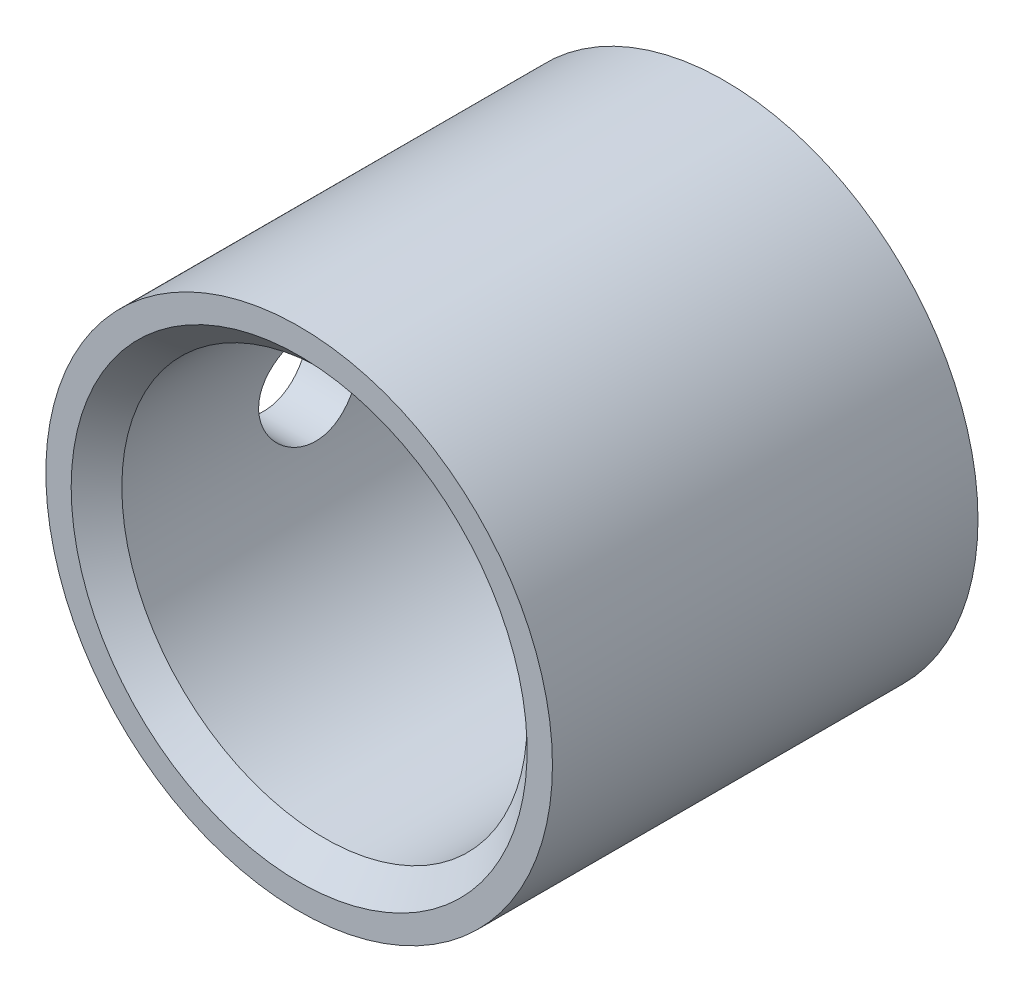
ISO-10303-21;
HEADER;
FILE_DESCRIPTION(('STEP AP214'),'2;1');
FILE_NAME('part.step','',(''),(''),'','','');
FILE_SCHEMA(('AUTOMOTIVE_DESIGN { 1 0 10303 214 1 1 1 1 }'));
ENDSEC;
DATA;
#1=APPLICATION_CONTEXT('core data for automotive mechanical design processes');
#2=APPLICATION_PROTOCOL_DEFINITION('international standard','automotive_design',2000,#1);
#3=PRODUCT_CONTEXT('',#1,'mechanical');
#4=PRODUCT('Part','Part','',(#3));
#5=PRODUCT_RELATED_PRODUCT_CATEGORY('part','',(#4));
#6=PRODUCT_DEFINITION_FORMATION('','',#4);
#7=PRODUCT_DEFINITION_CONTEXT('part definition',#1,'design');
#8=PRODUCT_DEFINITION('design','',#6,#7);
#9=PRODUCT_DEFINITION_SHAPE('','',#8);
#10=(LENGTH_UNIT() NAMED_UNIT(*) SI_UNIT(.MILLI.,.METRE.));
#11=(NAMED_UNIT(*) PLANE_ANGLE_UNIT() SI_UNIT($,.RADIAN.));
#12=(NAMED_UNIT(*) SI_UNIT($,.STERADIAN.) SOLID_ANGLE_UNIT());
#13=UNCERTAINTY_MEASURE_WITH_UNIT(LENGTH_MEASURE(1.E-05),#10,'distance_accuracy_value','');
#14=(GEOMETRIC_REPRESENTATION_CONTEXT(3) GLOBAL_UNCERTAINTY_ASSIGNED_CONTEXT((#13)) GLOBAL_UNIT_ASSIGNED_CONTEXT((#10,
#11,#12)) REPRESENTATION_CONTEXT('',''));
#15=CARTESIAN_POINT('',(0.,0.,0.));
#16=DIRECTION('',(0.,0.,1.));
#17=DIRECTION('',(1.,0.,0.));
#18=AXIS2_PLACEMENT_3D('',#15,#16,#17);
#19=CARTESIAN_POINT('',(0.,0.,0.));
#20=DIRECTION('',(0.,0.,-1.));
#21=DIRECTION('',(-1.,0.,0.));
#22=AXIS2_PLACEMENT_3D('',#19,#20,#21);
#23=CYLINDRICAL_SURFACE('',#22,2.50000000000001);
#24=CARTESIAN_POINT('',(-2.50000000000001,0.,-2.6));
#25=CARTESIAN_POINT('',(-2.49999948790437,-0.0277884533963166,-2.59999897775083));
#26=CARTESIAN_POINT('',(-2.49953192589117,-0.0555898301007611,-2.59767557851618));
#27=CARTESIAN_POINT('',(-2.49771182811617,-0.11040675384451,-2.58845074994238));
#28=CARTESIAN_POINT('',(-2.49635858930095,-0.137421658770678,-2.58154568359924));
#29=CARTESIAN_POINT('',(-2.49291824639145,-0.189865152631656,-2.56337936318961));
#30=CARTESIAN_POINT('',(-2.4908318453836,-0.215295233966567,-2.55212228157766));
#31=CARTESIAN_POINT('',(-2.48615199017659,-0.263903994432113,-2.52558387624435));
#32=CARTESIAN_POINT('',(-2.48355856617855,-0.287082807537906,-2.5103027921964));
#33=CARTESIAN_POINT('',(-2.47811082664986,-0.330846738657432,-2.47593075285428));
#34=CARTESIAN_POINT('',(-2.47525372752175,-0.351396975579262,-2.4567958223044));
#35=CARTESIAN_POINT('',(-2.46962090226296,-0.389018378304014,-2.41535379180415));
#36=CARTESIAN_POINT('',(-2.46684518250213,-0.406089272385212,-2.39304644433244));
#37=CARTESIAN_POINT('',(-2.46166220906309,-0.43641587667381,-2.34564190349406));
#38=CARTESIAN_POINT('',(-2.45925853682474,-0.449635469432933,-2.32052117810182));
#39=CARTESIAN_POINT('',(-2.4551313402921,-0.471652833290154,-2.26835909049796));
#40=CARTESIAN_POINT('',(-2.45340774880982,-0.480451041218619,-2.24131791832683));
#41=CARTESIAN_POINT('',(-2.45086402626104,-0.493262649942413,-2.18645781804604));
#42=CARTESIAN_POINT('',(-2.45003235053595,-0.497337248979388,-2.15865372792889));
#43=CARTESIAN_POINT('',(-2.44933187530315,-0.500776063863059,-2.10274508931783));
#44=CARTESIAN_POINT('',(-2.44946297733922,-0.50014076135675,-2.07464057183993));
#45=CARTESIAN_POINT('',(-2.45066275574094,-0.494227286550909,-2.0193766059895));
#46=CARTESIAN_POINT('',(-2.45171726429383,-0.489019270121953,-1.99220929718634));
#47=CARTESIAN_POINT('',(-2.45462273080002,-0.474218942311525,-1.9391419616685));
#48=CARTESIAN_POINT('',(-2.45647372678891,-0.46462642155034,-1.9132419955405));
#49=CARTESIAN_POINT('',(-2.46077809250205,-0.44126239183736,-1.8632423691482));
#50=CARTESIAN_POINT('',(-2.46323544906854,-0.427463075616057,-1.83915606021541));
#51=CARTESIAN_POINT('',(-2.46847309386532,-0.396096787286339,-1.79361457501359));
#52=CARTESIAN_POINT('',(-2.47125341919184,-0.378529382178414,-1.77215970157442));
#53=CARTESIAN_POINT('',(-2.47688510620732,-0.339749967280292,-1.73208529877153));
#54=CARTESIAN_POINT('',(-2.47973684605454,-0.318478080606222,-1.71352371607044));
#55=CARTESIAN_POINT('',(-2.48514424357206,-0.273092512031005,-1.68022307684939));
#56=CARTESIAN_POINT('',(-2.48769989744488,-0.248978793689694,-1.66548406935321));
#57=CARTESIAN_POINT('',(-2.49223345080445,-0.19852969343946,-1.64023624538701));
#58=CARTESIAN_POINT('',(-2.49421044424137,-0.17219090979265,-1.62973405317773));
#59=CARTESIAN_POINT('',(-2.49735704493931,-0.118074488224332,-1.61331976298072));
#60=CARTESIAN_POINT('',(-2.49852675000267,-0.0902970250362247,-1.60740710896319));
#61=CARTESIAN_POINT('',(-2.49991335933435,-0.0345897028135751,-1.60042177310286));
#62=CARTESIAN_POINT('',(-2.50014587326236,-0.00667016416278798,-1.59926979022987));
#63=CARTESIAN_POINT('',(-2.49967525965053,0.0489624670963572,-1.60162492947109));
#64=CARTESIAN_POINT('',(-2.49897218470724,0.0766755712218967,-1.6051317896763));
#65=CARTESIAN_POINT('',(-2.4967191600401,0.130852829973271,-1.61663918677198));
#66=CARTESIAN_POINT('',(-2.49517688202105,0.157325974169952,-1.62459903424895));
#67=CARTESIAN_POINT('',(-2.49141776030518,0.208561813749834,-1.64474199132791));
#68=CARTESIAN_POINT('',(-2.48920086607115,0.23332438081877,-1.65692541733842));
#69=CARTESIAN_POINT('',(-2.48429955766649,0.280770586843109,-1.68534124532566));
#70=CARTESIAN_POINT('',(-2.48160975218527,0.303425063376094,-1.70162139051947));
#71=CARTESIAN_POINT('',(-2.47607367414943,0.345709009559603,-1.73770459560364));
#72=CARTESIAN_POINT('',(-2.47322738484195,0.365338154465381,-1.75750803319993));
#73=CARTESIAN_POINT('',(-2.46764651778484,0.401320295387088,-1.80043667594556));
#74=CARTESIAN_POINT('',(-2.46491430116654,0.417618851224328,-1.82360787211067));
#75=CARTESIAN_POINT('',(-2.45992095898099,0.446092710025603,-1.87240568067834));
#76=CARTESIAN_POINT('',(-2.45765981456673,0.458268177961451,-1.89803219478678));
#77=CARTESIAN_POINT('',(-2.45388370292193,0.47807592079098,-1.95088412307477));
#78=CARTESIAN_POINT('',(-2.45236487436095,0.485731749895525,-1.97810042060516));
#79=CARTESIAN_POINT('',(-2.45023718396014,0.496354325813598,-2.03346672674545));
#80=CARTESIAN_POINT('',(-2.44962820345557,0.499321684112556,-2.06161661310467));
#81=CARTESIAN_POINT('',(-2.44939574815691,0.500460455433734,-2.11750443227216));
#82=CARTESIAN_POINT('',(-2.44975459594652,0.498717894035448,-2.14524057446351));
#83=CARTESIAN_POINT('',(-2.45137786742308,0.49067615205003,-2.20001582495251));
#84=CARTESIAN_POINT('',(-2.45264228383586,0.484377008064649,-2.2270549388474));
#85=CARTESIAN_POINT('',(-2.45592632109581,0.467439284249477,-2.27961385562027));
#86=CARTESIAN_POINT('',(-2.45794410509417,0.456811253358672,-2.30513718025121));
#87=CARTESIAN_POINT('',(-2.46250857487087,0.431527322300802,-2.35405186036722));
#88=CARTESIAN_POINT('',(-2.46505530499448,0.416871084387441,-2.37744303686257));
#89=CARTESIAN_POINT('',(-2.47044480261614,0.383652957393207,-2.42185778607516));
#90=CARTESIAN_POINT('',(-2.47329186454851,0.36502894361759,-2.4428343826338));
#91=CARTESIAN_POINT('',(-2.47893040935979,0.32453218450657,-2.48139310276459));
#92=CARTESIAN_POINT('',(-2.48172187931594,0.302658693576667,-2.49897444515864));
#93=CARTESIAN_POINT('',(-2.48696916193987,0.256008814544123,-2.53041732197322));
#94=CARTESIAN_POINT('',(-2.48942115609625,0.231204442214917,-2.54423800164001));
#95=CARTESIAN_POINT('',(-2.49367562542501,0.179583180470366,-2.5674930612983));
#96=CARTESIAN_POINT('',(-2.49547868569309,0.152768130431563,-2.57693139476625));
#97=CARTESIAN_POINT('',(-2.49788186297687,0.104910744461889,-2.58932597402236));
#98=CARTESIAN_POINT('',(-2.49867151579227,0.0841408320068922,-2.59332159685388));
#99=CARTESIAN_POINT('',(-2.49973077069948,0.0422497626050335,-2.59865895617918));
#100=CARTESIAN_POINT('',(-2.50000038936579,0.0211286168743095,-2.60000077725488));
#101=CARTESIAN_POINT('',(-2.50000000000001,0.,-2.6));
#102=B_SPLINE_CURVE_WITH_KNOTS('',3,(#24,#25,#26,#27,#28,#29,#30,#31,#32,#33,#34,#35,#36,#37,
#38,#39,#40,#41,#42,#43,#44,#45,#46,#47,#48,#49,#50,#51,#52,#53,#54,#55,#56,#57,#58,#59,#60,#61,
#62,#63,#64,#65,#66,#67,#68,#69,#70,#71,#72,#73,#74,#75,#76,#77,#78,#79,#80,#81,#82,#83,#84,#85,
#86,#87,#88,#89,#90,#91,#92,#93,#94,#95,#96,#97,#98,#99,#100,#101),.UNSPECIFIED.,.T.,.F.,(4,2,2,
2,2,2,2,2,2,2,2,2,2,2,2,2,2,2,2,2,2,2,2,2,2,2,2,2,2,2,2,2,2,2,2,2,2,2,4),(0.,0.0832880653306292,
0.166642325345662,0.249916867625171,0.333186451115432,0.417466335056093,0.501752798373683,
0.586805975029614,0.671850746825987,0.755780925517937,0.839702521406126,0.922358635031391,
1.00501869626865,1.08823745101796,1.17146577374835,1.25619126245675,1.3409178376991,
1.42577637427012,1.51062462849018,1.59405367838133,1.67747803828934,1.76015226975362,
1.84283269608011,1.92652533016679,2.01022694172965,2.09520314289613,2.18017594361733,
2.26470190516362,2.34921684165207,2.43219861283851,2.51517971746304,2.59795980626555,
2.68074683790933,2.76494038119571,2.84915327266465,2.93424748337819,3.01926477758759,
3.08259387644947,3.14592095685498),.UNSPECIFIED.);
#103=CARTESIAN_POINT('',(-2.50000000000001,0.,-2.6));
#104=VERTEX_POINT('',#103);
#105=EDGE_CURVE('E378',#104,#104,#102,.T.);
#106=ORIENTED_EDGE('',*,*,#105,.F.);
#107=EDGE_LOOP('',(#106));
#108=FACE_BOUND('',#107,.T.);
#109=CARTESIAN_POINT('',(0.,0.,0.));
#110=DIRECTION('',(0.,0.,-1.));
#111=DIRECTION('',(1.,0.,0.));
#112=AXIS2_PLACEMENT_3D('',#109,#110,#111);
#113=CIRCLE('',#112,2.50000000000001);
#114=CARTESIAN_POINT('',(2.50000000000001,0.,0.));
#115=VERTEX_POINT('',#114);
#116=EDGE_CURVE('E10',#115,#115,#113,.T.);
#117=ORIENTED_EDGE('',*,*,#116,.T.);
#118=EDGE_LOOP('',(#117));
#119=FACE_BOUND('',#118,.T.);
#120=CARTESIAN_POINT('',(0.,0.,-4.2));
#121=DIRECTION('',(0.,0.,-1.));
#122=DIRECTION('',(1.,0.,0.));
#123=AXIS2_PLACEMENT_3D('',#120,#121,#122);
#124=CIRCLE('',#123,2.50000000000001);
#125=CARTESIAN_POINT('',(2.50000000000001,0.,-4.2));
#126=VERTEX_POINT('',#125);
#127=EDGE_CURVE('E360',#126,#126,#124,.T.);
#128=ORIENTED_EDGE('',*,*,#127,.F.);
#129=EDGE_LOOP('',(#128));
#130=FACE_BOUND('',#129,.T.);
#131=ADVANCED_FACE('F348',(#108,#119,#130),#23,.T.);
#132=CARTESIAN_POINT('',(0.,0.,0.));
#133=DIRECTION('',(0.,0.,1.));
#134=DIRECTION('',(1.,0.,0.));
#135=AXIS2_PLACEMENT_3D('',#132,#133,#134);
#136=PLANE('',#135);
#137=CARTESIAN_POINT('',(0.,0.,0.));
#138=DIRECTION('',(0.,0.,1.));
#139=DIRECTION('',(-1.,0.,0.));
#140=AXIS2_PLACEMENT_3D('',#137,#138,#139);
#141=CIRCLE('',#140,2.24999999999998);
#142=CARTESIAN_POINT('',(-2.24999999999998,0.,0.));
#143=VERTEX_POINT('',#142);
#144=EDGE_CURVE('E375',#143,#143,#141,.T.);
#145=ORIENTED_EDGE('',*,*,#144,.F.);
#146=EDGE_LOOP('',(#145));
#147=FACE_BOUND('',#146,.T.);
#148=ORIENTED_EDGE('',*,*,#116,.F.);
#149=EDGE_LOOP('',(#148));
#150=FACE_BOUND('',#149,.T.);
#151=ADVANCED_FACE('F402',(#147,#150),#136,.T.);
#152=CARTESIAN_POINT('',(0.,0.,-4.2));
#153=DIRECTION('',(0.,0.,1.));
#154=DIRECTION('',(1.,0.,0.));
#155=AXIS2_PLACEMENT_3D('',#152,#153,#154);
#156=PLANE('',#155);
#157=CARTESIAN_POINT('',(0.,0.,-4.2));
#158=DIRECTION('',(0.,0.,-1.));
#159=DIRECTION('',(1.,0.,0.));
#160=AXIS2_PLACEMENT_3D('',#157,#158,#159);
#161=CIRCLE('',#160,2.24999999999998);
#162=CARTESIAN_POINT('',(2.24999999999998,0.,-4.2));
#163=VERTEX_POINT('',#162);
#164=EDGE_CURVE('E364',#163,#163,#161,.T.);
#165=ORIENTED_EDGE('',*,*,#164,.F.);
#166=EDGE_LOOP('',(#165));
#167=FACE_BOUND('',#166,.T.);
#168=ORIENTED_EDGE('',*,*,#127,.T.);
#169=EDGE_LOOP('',(#168));
#170=FACE_BOUND('',#169,.T.);
#171=ADVANCED_FACE('F399',(#167,#170),#156,.F.);
#172=CARTESIAN_POINT('',(0.,0.,-4.2));
#173=DIRECTION('',(0.,0.,-1.));
#174=DIRECTION('',(1.,0.,0.));
#175=AXIS2_PLACEMENT_3D('',#172,#173,#174);
#176=CONICAL_SURFACE('',#175,2.24999999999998,0.785398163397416);
#177=CARTESIAN_POINT('',(0.,0.,-3.95));
#178=DIRECTION('',(0.,0.,-1.));
#179=DIRECTION('',(1.,0.,0.));
#180=AXIS2_PLACEMENT_3D('',#177,#178,#179);
#181=CIRCLE('',#180,2.);
#182=CARTESIAN_POINT('',(2.,0.,-3.95));
#183=VERTEX_POINT('',#182);
#184=EDGE_CURVE('E369',#183,#183,#181,.T.);
#185=ORIENTED_EDGE('',*,*,#184,.F.);
#186=EDGE_LOOP('',(#185));
#187=FACE_BOUND('',#186,.T.);
#188=ORIENTED_EDGE('',*,*,#164,.T.);
#189=EDGE_LOOP('',(#188));
#190=FACE_BOUND('',#189,.T.);
#191=ADVANCED_FACE('F395',(#187,#190),#176,.F.);
#192=CARTESIAN_POINT('',(0.,0.,-0.25));
#193=DIRECTION('',(0.,0.,-1.));
#194=DIRECTION('',(-1.,0.,0.));
#195=AXIS2_PLACEMENT_3D('',#192,#193,#194);
#196=CYLINDRICAL_SURFACE('',#195,2.);
#197=CARTESIAN_POINT('',(-2.,0.,-1.6));
#198=CARTESIAN_POINT('',(-1.99999953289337,0.0276253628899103,-1.60000077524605));
#199=CARTESIAN_POINT('',(-1.99942192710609,0.0552593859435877,-1.60229718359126));
#200=CARTESIAN_POINT('',(-1.9971737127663,0.109735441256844,-1.611408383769));
#201=CARTESIAN_POINT('',(-1.99550248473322,0.13657701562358,-1.61822573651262));
#202=CARTESIAN_POINT('',(-1.99125208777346,0.188673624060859,-1.6361464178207));
#203=CARTESIAN_POINT('',(-1.98867400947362,0.213930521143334,-1.64724459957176));
#204=CARTESIAN_POINT('',(-1.98288447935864,0.262224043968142,-1.67339379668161));
#205=CARTESIAN_POINT('',(-1.97967300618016,0.28526059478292,-1.68844494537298));
#206=CARTESIAN_POINT('',(-1.97289137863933,0.328933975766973,-1.72240026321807));
#207=CARTESIAN_POINT('',(-1.9693156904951,0.34951856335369,-1.74137052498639));
#208=CARTESIAN_POINT('',(-1.96224540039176,0.387249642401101,-1.78248406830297));
#209=CARTESIAN_POINT('',(-1.95875080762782,0.404395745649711,-1.80462770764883));
#210=CARTESIAN_POINT('',(-1.9521825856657,0.435008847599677,-1.85186507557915));
#211=CARTESIAN_POINT('',(-1.94911598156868,0.448417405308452,-1.87699774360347));
#212=CARTESIAN_POINT('',(-1.94383164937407,0.470798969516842,-1.92924947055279));
#213=CARTESIAN_POINT('',(-1.94161378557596,0.479772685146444,-1.95636821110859));
#214=CARTESIAN_POINT('',(-1.93833492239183,0.492851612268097,-2.01124783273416));
#215=CARTESIAN_POINT('',(-1.93725163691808,0.497050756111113,-2.03898496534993));
#216=CARTESIAN_POINT('',(-1.9362978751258,0.500753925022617,-2.09478952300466));
#217=CARTESIAN_POINT('',(-1.93642720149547,0.500258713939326,-2.1228568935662));
#218=CARTESIAN_POINT('',(-1.93786401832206,0.49466217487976,-2.17780526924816));
#219=CARTESIAN_POINT('',(-1.93914287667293,0.489672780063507,-2.20469854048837));
#220=CARTESIAN_POINT('',(-1.94268903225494,0.475408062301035,-2.2572536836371));
#221=CARTESIAN_POINT('',(-1.94495639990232,0.466132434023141,-2.28291546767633));
#222=CARTESIAN_POINT('',(-1.95025037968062,0.443463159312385,-2.33257933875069));
#223=CARTESIAN_POINT('',(-1.95328442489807,0.430028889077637,-2.35656205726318));
#224=CARTESIAN_POINT('',(-1.95976570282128,0.399452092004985,-2.40197290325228));
#225=CARTESIAN_POINT('',(-1.96321300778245,0.382308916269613,-2.42340058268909));
#226=CARTESIAN_POINT('',(-1.9702529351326,0.344221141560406,-2.4637345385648));
#227=CARTESIAN_POINT('',(-1.9738468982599,0.323182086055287,-2.48255149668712));
#228=CARTESIAN_POINT('',(-1.98068655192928,0.278203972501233,-2.5164070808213));
#229=CARTESIAN_POINT('',(-1.98393223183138,0.254264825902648,-2.53144559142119));
#230=CARTESIAN_POINT('',(-1.98972577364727,0.204038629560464,-2.55735019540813));
#231=CARTESIAN_POINT('',(-1.99227120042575,0.177743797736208,-2.56820178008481));
#232=CARTESIAN_POINT('',(-1.99635972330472,0.123625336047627,-2.58530576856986));
#233=CARTESIAN_POINT('',(-1.99790301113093,0.0958019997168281,-2.59155905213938));
#234=CARTESIAN_POINT('',(-1.99978499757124,0.0401799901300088,-2.59915252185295));
#235=CARTESIAN_POINT('',(-2.00015351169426,0.0123989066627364,-2.6006143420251));
#236=CARTESIAN_POINT('',(-1.9997293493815,-0.0430109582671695,-2.59891699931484));
#237=CARTESIAN_POINT('',(-1.99893677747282,-0.0706397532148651,-2.59575825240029));
#238=CARTESIAN_POINT('',(-1.99629860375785,-0.124538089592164,-2.58500969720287));
#239=CARTESIAN_POINT('',(-1.99446878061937,-0.150821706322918,-2.57748624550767));
#240=CARTESIAN_POINT('',(-1.98996235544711,-0.201752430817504,-2.55829763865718));
#241=CARTESIAN_POINT('',(-1.98728566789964,-0.226399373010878,-2.54663206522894));
#242=CARTESIAN_POINT('',(-1.98131102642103,-0.273841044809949,-2.51925462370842));
#243=CARTESIAN_POINT('',(-1.9780028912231,-0.29659514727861,-2.50347462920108));
#244=CARTESIAN_POINT('',(-1.97114836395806,-0.339175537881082,-2.46840336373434));
#245=CARTESIAN_POINT('',(-1.96760193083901,-0.359001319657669,-2.44911148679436));
#246=CARTESIAN_POINT('',(-1.96056318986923,-0.39566352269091,-2.40699934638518));
#247=CARTESIAN_POINT('',(-1.95707434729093,-0.412414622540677,-2.38410409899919));
#248=CARTESIAN_POINT('',(-1.95064292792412,-0.441836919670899,-2.33575578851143));
#249=CARTESIAN_POINT('',(-1.94770032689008,-0.454508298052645,-2.31030283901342));
#250=CARTESIAN_POINT('',(-1.94272698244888,-0.475317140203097,-2.25769809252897));
#251=CARTESIAN_POINT('',(-1.94069085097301,-0.483481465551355,-2.23055745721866));
#252=CARTESIAN_POINT('',(-1.93775581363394,-0.495115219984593,-2.17523012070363));
#253=CARTESIAN_POINT('',(-1.93685665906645,-0.498585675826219,-2.14704364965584));
#254=CARTESIAN_POINT('',(-1.93631633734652,-0.500679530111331,-2.09129299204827));
#255=CARTESIAN_POINT('',(-1.93663977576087,-0.499439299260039,-2.06373418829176));
#256=CARTESIAN_POINT('',(-1.93842636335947,-0.492459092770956,-2.00923203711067));
#257=CARTESIAN_POINT('',(-1.93988948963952,-0.486719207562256,-1.98228867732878));
#258=CARTESIAN_POINT('',(-1.9437708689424,-0.470977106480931,-1.92993051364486));
#259=CARTESIAN_POINT('',(-1.94618338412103,-0.461000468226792,-1.90450756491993));
#260=CARTESIAN_POINT('',(-1.95169251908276,-0.437088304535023,-1.8556782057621));
#261=CARTESIAN_POINT('',(-1.95478923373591,-0.423152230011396,-1.83227207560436));
#262=CARTESIAN_POINT('',(-1.96141878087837,-0.391289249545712,-1.78748179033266));
#263=CARTESIAN_POINT('',(-1.96496088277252,-0.373267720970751,-1.76616630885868));
#264=CARTESIAN_POINT('',(-1.97202675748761,-0.333929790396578,-1.72681765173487));
#265=CARTESIAN_POINT('',(-1.97555052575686,-0.312612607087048,-1.70878525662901));
#266=CARTESIAN_POINT('',(-1.98225885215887,-0.266822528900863,-1.67619623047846));
#267=CARTESIAN_POINT('',(-1.98543611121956,-0.242299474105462,-1.66170846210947));
#268=CARTESIAN_POINT('',(-1.99101641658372,-0.191088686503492,-1.63708417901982));
#269=CARTESIAN_POINT('',(-1.9934200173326,-0.16440252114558,-1.62694454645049));
#270=CARTESIAN_POINT('',(-1.99682686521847,-0.114803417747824,-1.61280938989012));
#271=CARTESIAN_POINT('',(-1.9980086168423,-0.0921267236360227,-1.60801625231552));
#272=CARTESIAN_POINT('',(-1.99959535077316,-0.0463020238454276,-1.60161135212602));
#273=CARTESIAN_POINT('',(-2.00000039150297,-0.0231540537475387,-1.59999935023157));
#274=CARTESIAN_POINT('',(-2.,0.,-1.6));
#275=B_SPLINE_CURVE_WITH_KNOTS('',3,(#197,#198,#199,#200,#201,#202,#203,#204,#205,#206,#207,
#208,#209,#210,#211,#212,#213,#214,#215,#216,#217,#218,#219,#220,#221,#222,#223,#224,#225,#226,
#227,#228,#229,#230,#231,#232,#233,#234,#235,#236,#237,#238,#239,#240,#241,#242,#243,#244,#245,
#246,#247,#248,#249,#250,#251,#252,#253,#254,#255,#256,#257,#258,#259,#260,#261,#262,#263,#264,
#265,#266,#267,#268,#269,#270,#271,#272,#273,#274),.UNSPECIFIED.,.T.,.F.,(4,2,2,2,2,2,2,2,2,2,2,
2,2,2,2,2,2,2,2,2,2,2,2,2,2,2,2,2,2,2,2,2,2,2,2,2,2,2,4),(0.,0.0827912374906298,
0.165629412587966,0.248368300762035,0.331109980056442,0.41538145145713,0.499662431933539,
0.585195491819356,0.670714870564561,0.754520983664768,0.838313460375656,0.920074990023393,
1.00184234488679,1.08443509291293,1.16704230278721,1.25200500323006,1.33697029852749,
1.42222743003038,1.50746824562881,1.59052769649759,1.67357967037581,1.75540091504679,
1.83723042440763,1.92051195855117,2.0038078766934,2.08914836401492,2.17448506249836,
2.25930751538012,2.34411141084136,2.42647926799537,2.50884546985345,2.59072133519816,
2.67260856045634,2.75663192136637,2.84067523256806,2.92624061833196,3.01174454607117,
3.08114080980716,3.1505318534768),.UNSPECIFIED.);
#276=CARTESIAN_POINT('',(-2.,0.,-1.6));
#277=VERTEX_POINT('',#276);
#278=EDGE_CURVE('E352',#277,#277,#275,.T.);
#279=ORIENTED_EDGE('',*,*,#278,.T.);
#280=EDGE_LOOP('',(#279));
#281=FACE_BOUND('',#280,.T.);
#282=CARTESIAN_POINT('',(0.,0.,-0.25));
#283=DIRECTION('',(0.,0.,-1.));
#284=DIRECTION('',(-1.,0.,0.));
#285=AXIS2_PLACEMENT_3D('',#282,#283,#284);
#286=CIRCLE('',#285,2.);
#287=CARTESIAN_POINT('',(-2.,0.,-0.25));
#288=VERTEX_POINT('',#287);
#289=EDGE_CURVE('E372',#288,#288,#286,.F.);
#290=ORIENTED_EDGE('',*,*,#289,.T.);
#291=EDGE_LOOP('',(#290));
#292=FACE_BOUND('',#291,.T.);
#293=ORIENTED_EDGE('',*,*,#184,.T.);
#294=EDGE_LOOP('',(#293));
#295=FACE_BOUND('',#294,.T.);
#296=ADVANCED_FACE('F390',(#281,#292,#295),#196,.F.);
#297=CARTESIAN_POINT('',(0.,0.,0.));
#298=DIRECTION('',(0.,0.,1.));
#299=DIRECTION('',(-1.,0.,0.));
#300=AXIS2_PLACEMENT_3D('',#297,#298,#299);
#301=CONICAL_SURFACE('',#300,2.24999999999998,0.785398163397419);
#302=ORIENTED_EDGE('',*,*,#289,.F.);
#303=EDGE_LOOP('',(#302));
#304=FACE_BOUND('',#303,.T.);
#305=ORIENTED_EDGE('',*,*,#144,.T.);
#306=EDGE_LOOP('',(#305));
#307=FACE_BOUND('',#306,.T.);
#308=ADVANCED_FACE('F386',(#304,#307),#301,.F.);
#309=CARTESIAN_POINT('',(-2.50000000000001,0.,-2.1));
#310=DIRECTION('',(1.,0.,0.));
#311=DIRECTION('',(0.,0.,-1.));
#312=AXIS2_PLACEMENT_3D('',#309,#310,#311);
#313=CYLINDRICAL_SURFACE('',#312,0.5);
#314=ORIENTED_EDGE('',*,*,#105,.T.);
#315=EDGE_LOOP('',(#314));
#316=FACE_BOUND('',#315,.T.);
#317=ORIENTED_EDGE('',*,*,#278,.F.);
#318=EDGE_LOOP('',(#317));
#319=FACE_BOUND('',#318,.T.);
#320=ADVANCED_FACE('F382',(#316,#319),#313,.F.);
#321=CLOSED_SHELL('',(#131,#151,#171,#191,#296,#308,#320));
#322=MANIFOLD_SOLID_BREP('B2',#321);
#323=ADVANCED_BREP_SHAPE_REPRESENTATION('',(#18,#322),#14);
#324=SHAPE_DEFINITION_REPRESENTATION(#9,#323);
ENDSEC;
END-ISO-10303-21;
